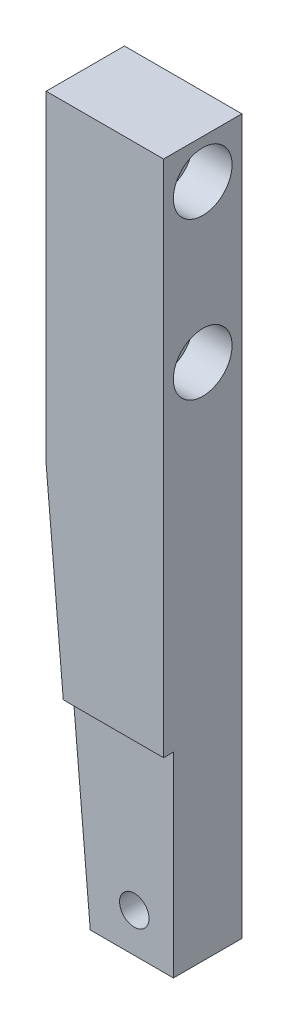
from build123d import *

# Parameters (mm, degrees)
SKETCH2_W                                        = 19.05
SKETCH2_H                                        = 115.8748
SKETCH2_R                                        = 2.3876
BOSS_EXTRUDE2_DEPTH                              = 6.35
CHAMFER1_SIZE                                    = 63.5
CHAMFER1_SIZE2                                   = 5.555530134
CBORE_FOR_1_4_SOCKET_HEAD_CAP_SCREW1_D           = 6.35
CBORE_FOR_1_4_SOCKET_HEAD_CAP_SCREW1_CBORE_D     = 9.525
CBORE_FOR_1_4_SOCKET_HEAD_CAP_SCREW1_CBORE_DEPTH = 6.35
SKETCH7_W                                        = 10.16
SKETCH7_H                                        = 38.1
CUT_EXTRUDE1_DEPTH                               = 30.48


with BuildPart() as part:
    # Sketch2 → Boss-Extrude2 (new, symmetric)
    with BuildSketch(Plane.XY):
        with Locations((9.525, -57.9374)):
            Rectangle(SKETCH2_W, SKETCH2_H)
        with Locations((12.7, -109.5248)):
            Circle(SKETCH2_R, mode=Mode.SUBTRACT)
    extrude(amount=BOSS_EXTRUDE2_DEPTH, both=True)

    # Chamfer1
    chamfer1_edges = [part.edges().sort_by_distance(p)[0] for p in [
        (0, -115.8748, 0),
    ]]
    chamfer1_side = [part.faces().sort_by_distance(p)[0] for p in [
        (0, -57.9374, 0),
    ]]
    chamfer(chamfer1_edges, length=CHAMFER1_SIZE, length2=CHAMFER1_SIZE2, reference=chamfer1_side[0])

    # CBORE for 1_4 Socket Head Cap Screw1 (through all)
    with Locations(Plane(origin=(19.05, 0, 0), x_dir=(0, 0, -1), z_dir=(1, 0, 0))):
        with Locations((0, -6.35), (0, -31.75)):
            CounterBoreHole(CBORE_FOR_1_4_SOCKET_HEAD_CAP_SCREW1_D / 2, CBORE_FOR_1_4_SOCKET_HEAD_CAP_SCREW1_CBORE_D / 2, CBORE_FOR_1_4_SOCKET_HEAD_CAP_SCREW1_CBORE_DEPTH)

    # Sketch7 → Cut-Extrude1 (cut)
    with BuildSketch(Plane(origin=(0, 0, 0), x_dir=(0, 0, -1), z_dir=(1, 0, 0))):
        with Locations((-9.8298, -103.1748)):
            Rectangle(SKETCH7_W, SKETCH7_H)
    extrude(amount=CUT_EXTRUDE1_DEPTH, mode=Mode.SUBTRACT)


solid = part.part
